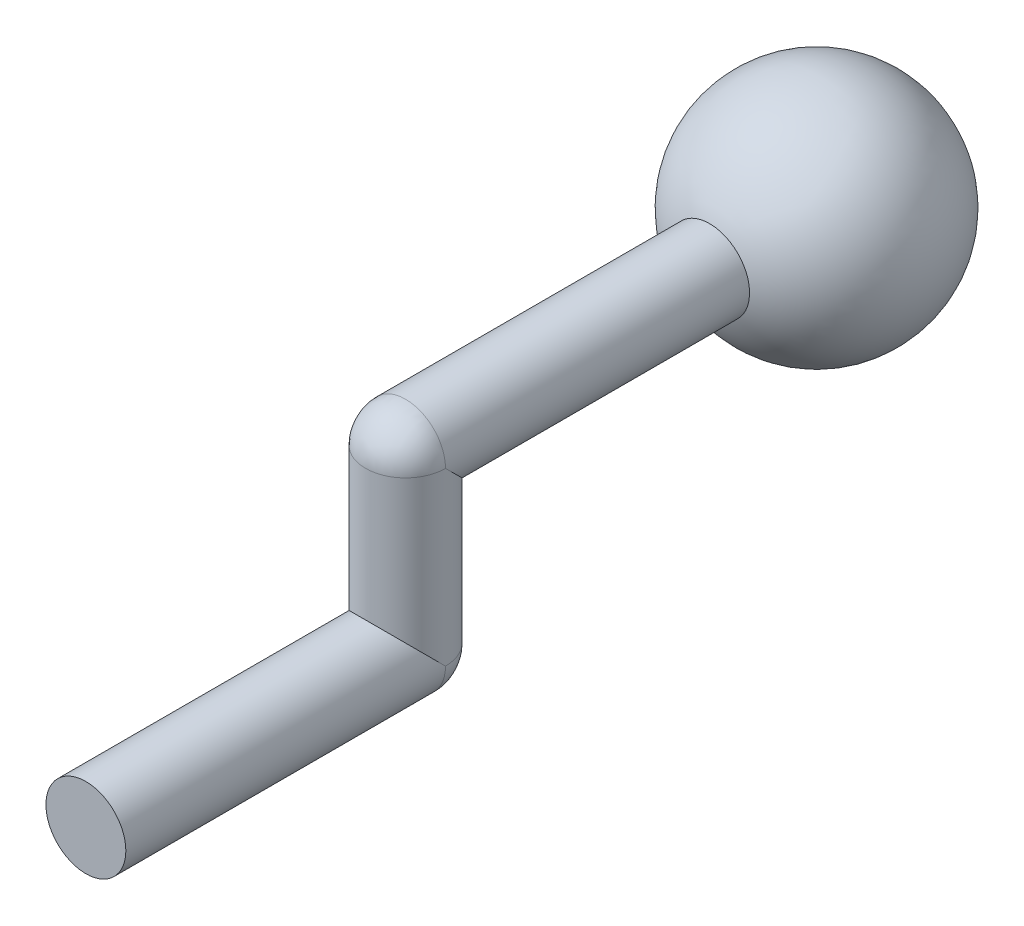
ISO-10303-21;
HEADER;
FILE_DESCRIPTION(('STEP AP214'),'2;1');
FILE_NAME('part.step','',(''),(''),'','','');
FILE_SCHEMA(('AUTOMOTIVE_DESIGN { 1 0 10303 214 1 1 1 1 }'));
ENDSEC;
DATA;
#1=APPLICATION_CONTEXT('core data for automotive mechanical design processes');
#2=APPLICATION_PROTOCOL_DEFINITION('international standard','automotive_design',2000,#1);
#3=PRODUCT_CONTEXT('',#1,'mechanical');
#4=PRODUCT('Part','Part','',(#3));
#5=PRODUCT_RELATED_PRODUCT_CATEGORY('part','',(#4));
#6=PRODUCT_DEFINITION_FORMATION('','',#4);
#7=PRODUCT_DEFINITION_CONTEXT('part definition',#1,'design');
#8=PRODUCT_DEFINITION('design','',#6,#7);
#9=PRODUCT_DEFINITION_SHAPE('','',#8);
#10=(LENGTH_UNIT() NAMED_UNIT(*) SI_UNIT(.MILLI.,.METRE.));
#11=(NAMED_UNIT(*) PLANE_ANGLE_UNIT() SI_UNIT($,.RADIAN.));
#12=(NAMED_UNIT(*) SI_UNIT($,.STERADIAN.) SOLID_ANGLE_UNIT());
#13=UNCERTAINTY_MEASURE_WITH_UNIT(LENGTH_MEASURE(1.E-05),#10,'distance_accuracy_value','');
#14=(GEOMETRIC_REPRESENTATION_CONTEXT(3) GLOBAL_UNCERTAINTY_ASSIGNED_CONTEXT((#13)) GLOBAL_UNIT_ASSIGNED_CONTEXT((#10,
#11,#12)) REPRESENTATION_CONTEXT('',''));
#15=CARTESIAN_POINT('',(0.,0.,0.));
#16=DIRECTION('',(0.,0.,1.));
#17=DIRECTION('',(1.,0.,0.));
#18=AXIS2_PLACEMENT_3D('',#15,#16,#17);
#19=CARTESIAN_POINT('',(0.,0.,28.));
#20=DIRECTION('',(0.,0.,-1.));
#21=DIRECTION('',(-1.,0.,0.));
#22=AXIS2_PLACEMENT_3D('',#19,#20,#21);
#23=CYLINDRICAL_SURFACE('',#22,3.5);
#24=CARTESIAN_POINT('',(0.,0.,28.));
#25=DIRECTION('',(0.,0.,1.));
#26=DIRECTION('',(1.,0.,0.));
#27=AXIS2_PLACEMENT_3D('',#24,#25,#26);
#28=CIRCLE('',#27,3.5);
#29=CARTESIAN_POINT('',(3.5,0.,28.));
#30=VERTEX_POINT('',#29);
#31=EDGE_CURVE('E39',#30,#30,#28,.T.);
#32=ORIENTED_EDGE('',*,*,#31,.F.);
#33=EDGE_LOOP('',(#32));
#34=FACE_BOUND('',#33,.T.);
#35=CARTESIAN_POINT('',(0.,0.,0.));
#36=DIRECTION('',(0.,0.707106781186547,-0.707106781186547));
#37=DIRECTION('',(0.,-0.707106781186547,-0.707106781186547));
#38=AXIS2_PLACEMENT_3D('',#35,#36,#37);
#39=ELLIPSE('',#38,4.94974746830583,3.5);
#40=CARTESIAN_POINT('',(-3.5,0.,0.));
#41=VERTEX_POINT('',#40);
#42=CARTESIAN_POINT('',(3.5,0.,0.));
#43=VERTEX_POINT('',#42);
#44=EDGE_CURVE('E65',#41,#43,#39,.T.);
#45=ORIENTED_EDGE('',*,*,#44,.F.);
#46=CARTESIAN_POINT('',(0.,0.,0.));
#47=DIRECTION('',(0.,0.,1.));
#48=DIRECTION('',(1.,0.,0.));
#49=AXIS2_PLACEMENT_3D('',#46,#47,#48);
#50=CIRCLE('',#49,3.5);
#51=EDGE_CURVE('E45',#41,#43,#50,.T.);
#52=ORIENTED_EDGE('',*,*,#51,.T.);
#53=EDGE_LOOP('',(#45,#52));
#54=FACE_BOUND('',#53,.T.);
#55=ADVANCED_FACE('F32',(#34,#54),#23,.T.);
#56=CARTESIAN_POINT('',(0.,0.,28.));
#57=DIRECTION('',(0.,0.,1.));
#58=DIRECTION('',(1.,0.,0.));
#59=AXIS2_PLACEMENT_3D('',#56,#57,#58);
#60=PLANE('',#59);
#61=ORIENTED_EDGE('',*,*,#31,.T.);
#62=EDGE_LOOP('',(#61));
#63=FACE_BOUND('',#62,.T.);
#64=ADVANCED_FACE('F74',(#63),#60,.T.);
#65=CARTESIAN_POINT('',(0.,15.,0.));
#66=DIRECTION('',(0.,-1.,0.));
#67=DIRECTION('',(0.,0.,-1.));
#68=AXIS2_PLACEMENT_3D('',#65,#66,#67);
#69=CYLINDRICAL_SURFACE('',#68,3.5);
#70=CARTESIAN_POINT('',(0.,15.,0.));
#71=DIRECTION('',(0.,1.,0.));
#72=DIRECTION('',(0.,0.,1.));
#73=AXIS2_PLACEMENT_3D('',#70,#71,#72);
#74=CIRCLE('',#73,3.5);
#75=CARTESIAN_POINT('',(-3.5,15.,0.));
#76=VERTEX_POINT('',#75);
#77=CARTESIAN_POINT('',(3.5,15.,0.));
#78=VERTEX_POINT('',#77);
#79=EDGE_CURVE('E62',#76,#78,#74,.T.);
#80=ORIENTED_EDGE('',*,*,#79,.F.);
#81=CARTESIAN_POINT('',(0.,15.,0.));
#82=DIRECTION('',(0.,-0.707106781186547,0.707106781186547));
#83=DIRECTION('',(0.,-0.707106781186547,-0.707106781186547));
#84=AXIS2_PLACEMENT_3D('',#81,#82,#83);
#85=ELLIPSE('',#84,4.94974746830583,3.5);
#86=EDGE_CURVE('E52',#76,#78,#85,.T.);
#87=ORIENTED_EDGE('',*,*,#86,.T.);
#88=EDGE_LOOP('',(#80,#87));
#89=FACE_BOUND('',#88,.T.);
#90=CARTESIAN_POINT('',(0.,0.,0.));
#91=DIRECTION('',(0.,1.,0.));
#92=DIRECTION('',(0.,0.,1.));
#93=AXIS2_PLACEMENT_3D('',#90,#91,#92);
#94=CIRCLE('',#93,3.5);
#95=EDGE_CURVE('E58',#43,#41,#94,.T.);
#96=ORIENTED_EDGE('',*,*,#95,.T.);
#97=ORIENTED_EDGE('',*,*,#44,.T.);
#98=EDGE_LOOP('',(#96,#97));
#99=FACE_BOUND('',#98,.T.);
#100=ADVANCED_FACE('F67',(#89,#99),#69,.T.);
#101=CARTESIAN_POINT('',(0.,15.,-36.));
#102=DIRECTION('',(0.,0.,1.));
#103=DIRECTION('',(1.,0.,0.));
#104=AXIS2_PLACEMENT_3D('',#101,#102,#103);
#105=CYLINDRICAL_SURFACE('',#104,3.5);
#106=CARTESIAN_POINT('',(0.,15.,-26.6325030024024));
#107=DIRECTION('',(0.,0.,-1.));
#108=DIRECTION('',(-1.,0.,0.));
#109=AXIS2_PLACEMENT_3D('',#106,#107,#108);
#110=CIRCLE('',#109,3.5);
#111=CARTESIAN_POINT('',(-3.5,15.,-26.6325030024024));
#112=VERTEX_POINT('',#111);
#113=EDGE_CURVE('E11',#112,#112,#110,.T.);
#114=ORIENTED_EDGE('',*,*,#113,.F.);
#115=EDGE_LOOP('',(#114));
#116=FACE_BOUND('',#115,.T.);
#117=ORIENTED_EDGE('',*,*,#86,.F.);
#118=CARTESIAN_POINT('',(0.,15.,0.));
#119=DIRECTION('',(0.,0.,1.));
#120=DIRECTION('',(1.,0.,0.));
#121=AXIS2_PLACEMENT_3D('',#118,#119,#120);
#122=CIRCLE('',#121,3.5);
#123=EDGE_CURVE('E137',#78,#76,#122,.T.);
#124=ORIENTED_EDGE('',*,*,#123,.F.);
#125=EDGE_LOOP('',(#117,#124));
#126=FACE_BOUND('',#125,.T.);
#127=ADVANCED_FACE('F83',(#116,#126),#105,.T.);
#128=CARTESIAN_POINT('',(0.,15.,-36.));
#129=DIRECTION('',(0.,-1.,0.));
#130=DIRECTION('',(0.,0.,-1.));
#131=AXIS2_PLACEMENT_3D('',#128,#129,#130);
#132=SPHERICAL_SURFACE('',#131,10.);
#133=CARTESIAN_POINT('',(0.,15.,-36.));
#134=DIRECTION('',(0.,0.,-1.));
#135=DIRECTION('',(-1.,0.,0.));
#136=AXIS2_PLACEMENT_3D('',#133,#134,#135);
#137=SPHERICAL_SURFACE('',#136,10.);
#138=ORIENTED_EDGE('',*,*,#113,.T.);
#139=EDGE_LOOP('',(#138));
#140=FACE_BOUND('',#139,.T.);
#141=ADVANCED_FACE('F88',(#140),#137,.T.);
#142=CARTESIAN_POINT('',(0.,15.,0.));
#143=DIRECTION('',(-1.,0.,0.));
#144=DIRECTION('',(0.,1.,0.));
#145=AXIS2_PLACEMENT_3D('',#142,#143,#144);
#146=SPHERICAL_SURFACE('',#145,3.5);
#147=ORIENTED_EDGE('',*,*,#79,.T.);
#148=ORIENTED_EDGE('',*,*,#123,.T.);
#149=EDGE_LOOP('',(#147,#148));
#150=FACE_BOUND('',#149,.T.);
#151=ADVANCED_FACE('F92',(#150),#146,.T.);
#152=CARTESIAN_POINT('',(0.,0.,0.));
#153=DIRECTION('',(1.,0.,0.));
#154=DIRECTION('',(0.,0.,1.));
#155=AXIS2_PLACEMENT_3D('',#152,#153,#154);
#156=SPHERICAL_SURFACE('',#155,3.5);
#157=ORIENTED_EDGE('',*,*,#95,.F.);
#158=ORIENTED_EDGE('',*,*,#51,.F.);
#159=EDGE_LOOP('',(#157,#158));
#160=FACE_BOUND('',#159,.T.);
#161=ADVANCED_FACE('F59',(#160),#156,.T.);
#162=CLOSED_SHELL('',(#55,#64,#100,#127,#141,#151,#161));
#163=MANIFOLD_SOLID_BREP('B2',#162);
#164=ADVANCED_BREP_SHAPE_REPRESENTATION('',(#18,#163),#14);
#165=SHAPE_DEFINITION_REPRESENTATION(#9,#164);
ENDSEC;
END-ISO-10303-21;
